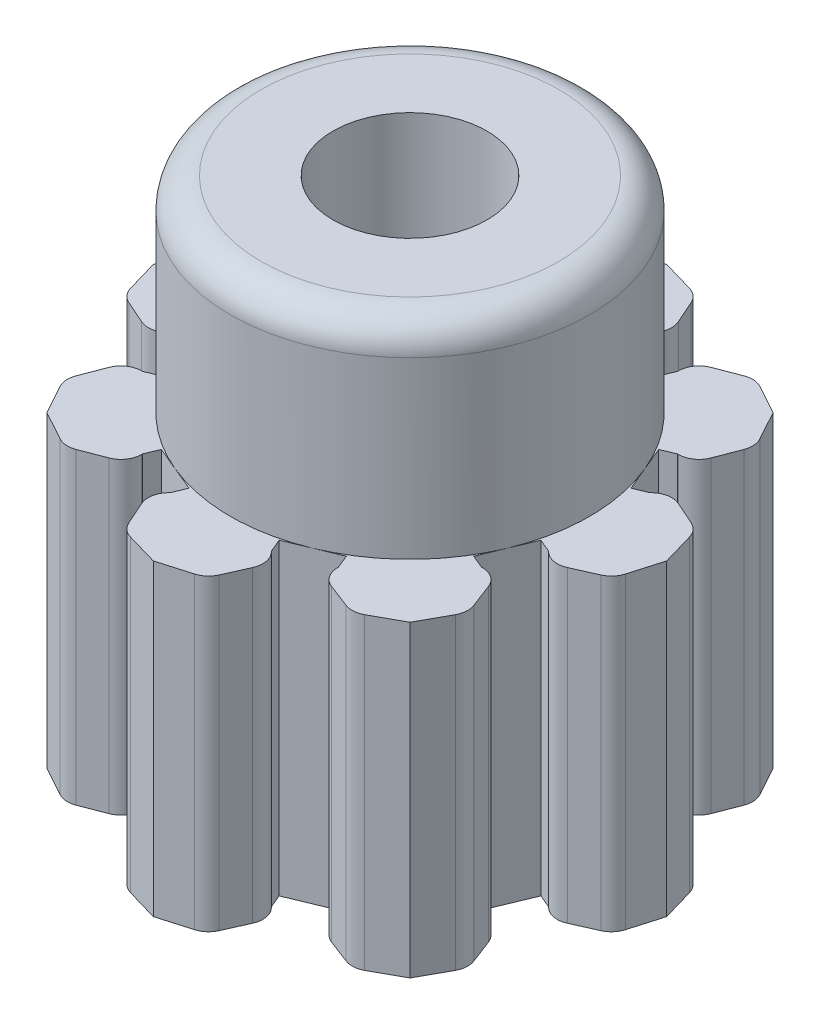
from build123d import *

# Parameters (mm, degrees)
SKETCH1_R           = 2.5
BOSS_EXTRUDE1_DEPTH = 3
SKETCH2_R           = 1.75
BOSS_EXTRUDE2_DEPTH = 2
SKETCH3_R           = 0.75
CUT_EXTRUDE1_DEPTH  = 7.123724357
SKETCH4_R           = 2.750200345
CUT_EXTRUDE3_DEPTH  = 5.636809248
SKETCH5_R           = 1.628426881
CUT_EXTRUDE4_DEPTH  = 0.1
FILLET1_R           = 0.3


with BuildPart() as part:
    # Sketch1 → Boss-Extrude1 (new body)
    with BuildSketch(Plane(origin=(0, 0, 0), x_dir=(1, 0, 0), z_dir=(0, 1, 0))):
        with Locations(Location((0, 0, 0), (0, 0, 270))):
            Circle(SKETCH1_R)
    extrude(amount=BOSS_EXTRUDE1_DEPTH)

    # Sketch2 → Boss-Extrude2 (add)
    with BuildSketch(Plane(origin=(0, 3, 0), x_dir=(1, 0, 0), z_dir=(0, 1, 0))):
        with Locations(Location((0, 0, 0), (0, 0, 270))):
            Circle(SKETCH2_R)
    extrude(amount=BOSS_EXTRUDE2_DEPTH)

    # Sketch3 → Cut-Extrude1 (cut, through all)
    with BuildSketch(Plane(origin=(0, 5, 0), x_dir=(1, 0, 0), z_dir=(0, 1, 0))):
        with Locations(Location((0, 0, 0), (0, 0, 270))):
            Circle(SKETCH3_R)
    extrude(amount=-CUT_EXTRUDE1_DEPTH, mode=Mode.SUBTRACT)

    # Sketch4 → Cut-Extrude3 (cut, through all)
    with BuildSketch(Plane(origin=(0, 3, 0), x_dir=(1, 0, 0), z_dir=(0, 1, 0))):
        Circle(SKETCH4_R)
        with BuildLine():
            Line((-1.71246004, 0.438726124), (-1.521118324, 0.90066589))
            Line((-1.521118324, 0.90066589), (-1.651645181, 0.954731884))
            Line((-1.651645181, 0.954731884), (-1.660451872, 0.954731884))
            ThreePointArc((-1.660451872, 0.954731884), (-1.773754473, 0.989921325), (-1.847186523, 1.083106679))
            Line((-1.847186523, 1.083106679), (-1.936085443, 1.314875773))
            ThreePointArc((-1.936085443, 1.314875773), (-1.948881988, 1.400186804), (-1.924557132, 1.482951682))
            Line((-1.924557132, 1.482951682), (-1.767766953, 1.767766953))
            Line((-1.767766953, 1.767766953), (-1.482951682, 1.924557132))
            ThreePointArc((-1.482951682, 1.924557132), (-1.400186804, 1.948881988), (-1.314875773, 1.936085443))
            Line((-1.314875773, 1.936085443), (-1.083106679, 1.847186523))
            ThreePointArc((-1.083106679, 1.847186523), (-0.989921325, 1.773754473), (-0.954731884, 1.660451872))
            Line((-0.954731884, 1.660451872), (-0.954731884, 1.651645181))
            Line((-0.954731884, 1.651645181), (-0.90066589, 1.521118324))
            Line((-0.90066589, 1.521118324), (-0.438726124, 1.71246004))
            Line((-0.438726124, 1.71246004), (-0.492792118, 1.842986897))
            Line((-0.492792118, 1.842986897), (-0.499019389, 1.849214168))
            ThreePointArc((-0.499019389, 1.849214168), (-0.554253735, 1.954213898), (-0.540286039, 2.072030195))
            Line((-0.540286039, 2.072030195), (-0.43926157, 2.298776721))
            ThreePointArc((-0.43926157, 2.298776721), (-0.387986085, 2.368149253), (-0.312262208, 2.409472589))
            Line((-0.312262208, 2.409472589), (0, 2.5))
            Line((0, 2.5), (0.312262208, 2.409472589))
            ThreePointArc((0.312262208, 2.409472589), (0.387986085, 2.368149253), (0.43926157, 2.298776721))
            Line((0.43926157, 2.298776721), (0.540286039, 2.072030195))
            ThreePointArc((0.540286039, 2.072030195), (0.554253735, 1.954213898), (0.499019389, 1.849214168))
            Line((0.499019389, 1.849214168), (0.492792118, 1.842986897))
            Line((0.492792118, 1.842986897), (0.438726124, 1.71246004))
            Line((0.438726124, 1.71246004), (0.90066589, 1.521118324))
            Line((0.90066589, 1.521118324), (0.954731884, 1.651645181))
            Line((0.954731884, 1.651645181), (0.954731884, 1.660451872))
            ThreePointArc((0.954731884, 1.660451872), (0.989921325, 1.773754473), (1.083106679, 1.847186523))
            Line((1.083106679, 1.847186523), (1.314875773, 1.936085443))
            ThreePointArc((1.314875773, 1.936085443), (1.400186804, 1.948881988), (1.482951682, 1.924557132))
            Line((1.482951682, 1.924557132), (1.767766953, 1.767766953))
            Line((1.767766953, 1.767766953), (1.924557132, 1.482951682))
            ThreePointArc((1.924557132, 1.482951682), (1.948881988, 1.400186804), (1.936085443, 1.314875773))
            Line((1.936085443, 1.314875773), (1.847186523, 1.083106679))
            ThreePointArc((1.847186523, 1.083106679), (1.773754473, 0.989921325), (1.660451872, 0.954731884))
            Line((1.660451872, 0.954731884), (1.651645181, 0.954731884))
            Line((1.651645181, 0.954731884), (1.521118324, 0.90066589))
            Line((1.521118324, 0.90066589), (1.71246004, 0.438726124))
            Line((1.71246004, 0.438726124), (1.842986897, 0.492792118))
            Line((1.842986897, 0.492792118), (1.849214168, 0.499019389))
            ThreePointArc((1.849214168, 0.499019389), (1.954213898, 0.554253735), (2.072030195, 0.540286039))
            Line((2.072030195, 0.540286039), (2.298776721, 0.43926157))
            ThreePointArc((2.298776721, 0.43926157), (2.368149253, 0.387986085), (2.409472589, 0.312262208))
            Line((2.409472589, 0.312262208), (2.5, 0))
            Line((2.5, 0), (2.409472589, -0.312262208))
            ThreePointArc((2.409472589, -0.312262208), (2.368149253, -0.387986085), (2.298776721, -0.43926157))
            Line((2.298776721, -0.43926157), (2.072030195, -0.540286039))
            ThreePointArc((2.072030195, -0.540286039), (1.954213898, -0.554253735), (1.849214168, -0.499019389))
            Line((1.849214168, -0.499019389), (1.842986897, -0.492792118))
            Line((1.842986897, -0.492792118), (1.71246004, -0.438726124))
            Line((1.71246004, -0.438726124), (1.521118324, -0.90066589))
            Line((1.521118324, -0.90066589), (1.651645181, -0.954731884))
            Line((1.651645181, -0.954731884), (1.660451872, -0.954731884))
            ThreePointArc((1.660451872, -0.954731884), (1.773754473, -0.989921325), (1.847186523, -1.083106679))
            Line((1.847186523, -1.083106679), (1.936085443, -1.314875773))
            ThreePointArc((1.936085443, -1.314875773), (1.948881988, -1.400186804), (1.924557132, -1.482951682))
            Line((1.924557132, -1.482951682), (1.767766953, -1.767766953))
            Line((1.767766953, -1.767766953), (1.482951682, -1.924557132))
            ThreePointArc((1.482951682, -1.924557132), (1.400186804, -1.948881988), (1.314875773, -1.936085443))
            Line((1.314875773, -1.936085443), (1.083106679, -1.847186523))
            ThreePointArc((1.083106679, -1.847186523), (0.989921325, -1.773754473), (0.954731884, -1.660451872))
            Line((0.954731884, -1.660451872), (0.954731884, -1.651645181))
            Line((0.954731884, -1.651645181), (0.90066589, -1.521118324))
            Line((0.90066589, -1.521118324), (0.438726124, -1.71246004))
            Line((0.438726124, -1.71246004), (0.492792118, -1.842986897))
            Line((0.492792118, -1.842986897), (0.499019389, -1.849214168))
            ThreePointArc((0.499019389, -1.849214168), (0.554253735, -1.954213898), (0.540286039, -2.072030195))
            Line((0.540286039, -2.072030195), (0.43926157, -2.298776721))
            ThreePointArc((0.43926157, -2.298776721), (0.387986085, -2.368149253), (0.312262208, -2.409472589))
            Line((0.312262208, -2.409472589), (0, -2.5))
            Line((0, -2.5), (-0.312262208, -2.409472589))
            ThreePointArc((-0.312262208, -2.409472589), (-0.387986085, -2.368149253), (-0.43926157, -2.298776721))
            Line((-0.43926157, -2.298776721), (-0.540286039, -2.072030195))
            ThreePointArc((-0.540286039, -2.072030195), (-0.554253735, -1.954213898), (-0.499019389, -1.849214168))
            Line((-0.499019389, -1.849214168), (-0.492792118, -1.842986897))
            Line((-0.492792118, -1.842986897), (-0.438726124, -1.71246004))
            Line((-0.438726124, -1.71246004), (-0.90066589, -1.521118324))
            Line((-0.90066589, -1.521118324), (-0.954731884, -1.651645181))
            Line((-0.954731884, -1.651645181), (-0.954731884, -1.660451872))
            ThreePointArc((-0.954731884, -1.660451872), (-0.989921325, -1.773754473), (-1.083106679, -1.847186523))
            Line((-1.083106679, -1.847186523), (-1.314875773, -1.936085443))
            ThreePointArc((-1.314875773, -1.936085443), (-1.400186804, -1.948881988), (-1.482951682, -1.924557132))
            Line((-1.482951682, -1.924557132), (-1.767766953, -1.767766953))
            Line((-1.767766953, -1.767766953), (-1.924557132, -1.482951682))
            ThreePointArc((-1.924557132, -1.482951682), (-1.948881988, -1.400186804), (-1.936085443, -1.314875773))
            Line((-1.936085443, -1.314875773), (-1.847186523, -1.083106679))
            ThreePointArc((-1.847186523, -1.083106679), (-1.773754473, -0.989921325), (-1.660451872, -0.954731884))
            Line((-1.660451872, -0.954731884), (-1.651645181, -0.954731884))
            Line((-1.651645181, -0.954731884), (-1.521118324, -0.90066589))
            Line((-1.521118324, -0.90066589), (-1.71246004, -0.438726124))
            Line((-1.71246004, -0.438726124), (-1.842986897, -0.492792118))
            Line((-1.842986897, -0.492792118), (-1.849214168, -0.499019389))
            ThreePointArc((-1.849214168, -0.499019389), (-1.954213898, -0.554253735), (-2.072030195, -0.540286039))
            Line((-2.072030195, -0.540286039), (-2.298776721, -0.43926157))
            ThreePointArc((-2.298776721, -0.43926157), (-2.368149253, -0.387986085), (-2.409472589, -0.312262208))
            Line((-2.409472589, -0.312262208), (-2.5, 0))
            Line((-2.5, 0), (-2.409472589, 0.312262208))
            ThreePointArc((-2.409472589, 0.312262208), (-2.368149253, 0.387986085), (-2.298776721, 0.43926157))
            Line((-2.298776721, 0.43926157), (-2.072030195, 0.540286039))
            ThreePointArc((-2.072030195, 0.540286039), (-1.954213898, 0.554253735), (-1.849214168, 0.499019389))
            Line((-1.849214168, 0.499019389), (-1.842986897, 0.492792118))
            Line((-1.842986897, 0.492792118), (-1.71246004, 0.438726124))
        make_face(mode=Mode.SUBTRACT)
    extrude(amount=-CUT_EXTRUDE3_DEPTH, mode=Mode.SUBTRACT)

    # Sketch5 → Cut-Extrude4 (cut)
    with BuildSketch(Plane.XZ):
        with Locations(Location((0, 0, 0), (0, 0, 270))):
            Circle(SKETCH5_R)
    extrude(amount=-CUT_EXTRUDE4_DEPTH, mode=Mode.SUBTRACT)

    # Fillet1
    fillet1_edges = [part.edges().sort_by_distance(p)[0] for p in [
        (0, 5, -1.75),
    ]]
    fillet(fillet1_edges, radius=FILLET1_R)


solid = part.part
